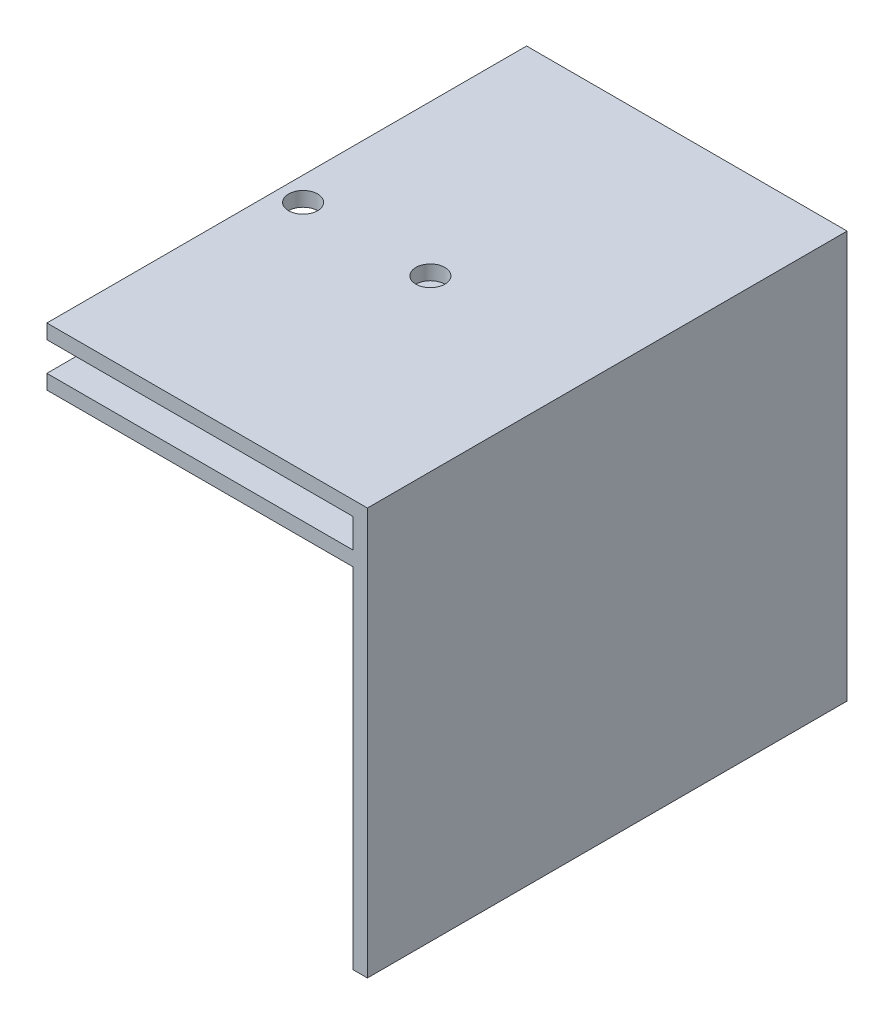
from build123d import *

# Parameters (mm, degrees)
BOSS_EXTRUDE1_DEPTH = 76.2
SKETCH2_W           = 70.0067765
SKETCH2_H           = 104.775
SKETCH2_R           = 3.175
BOSS_EXTRUDE2_DEPTH = 3.175
BOSS_EXTRUDE3_DEPTH = 6.35
SKETCH4_W           = 70.0067765
SKETCH4_H           = 104.775
SKETCH4_R           = 3.175
BOSS_EXTRUDE4_DEPTH = 3.175


with BuildPart() as part:
    # Sketch1 → Boss-Extrude1 (new body)
    with BuildSketch(Plane(origin=(0, 0, 0), x_dir=(1, 0, 0), z_dir=(0, 1, 0))):
        Polygon((7.9375, 50.8), (33.8709, 50.8), (33.8709, -50.8), (37.0459, -50.8), (37.0459, 53.975), (7.9375, 53.975), align=None)
    extrude(amount=BOSS_EXTRUDE1_DEPTH)

    # Sketch2 → Boss-Extrude2 (add)
    with BuildSketch(Plane(origin=(0, 76.2, 0), x_dir=(1, 0, 0), z_dir=(0, 1, 0))):
        with Locations((2.04251175, 1.5875)):
            Rectangle(SKETCH2_W, SKETCH2_H)
        with Locations(Location((0, 0, 0), (0, 0, 270))):
            Circle(SKETCH2_R, mode=Mode.SUBTRACT)
        with Locations(Location((-27.80029957, 0, 0), (0, 0, 270))):
            Circle(SKETCH2_R, mode=Mode.SUBTRACT)
    extrude(amount=BOSS_EXTRUDE2_DEPTH)

    # Sketch3 → Boss-Extrude3 (add)
    with BuildSketch(Plane(origin=(0, 79.375, 0), x_dir=(1, 0, 0), z_dir=(0, 1, 0))):
        Polygon((33.8709, 53.975), (-32.9608765, 53.975), (-32.9608765, 50.8), (33.8709, 50.8), (33.8709, -50.8), (37.0459, -50.8), (37.0459, 50.8), (37.0459, 53.975), align=None)
    extrude(amount=BOSS_EXTRUDE3_DEPTH)

    # Sketch4 → Boss-Extrude4 (add)
    with BuildSketch(Plane(origin=(0, 85.725, 0), x_dir=(1, 0, 0), z_dir=(0, 1, 0))):
        with Locations((2.04251175, 1.5875)):
            Rectangle(SKETCH4_W, SKETCH4_H)
        with Locations(Location((0, 0, 0), (0, 0, 270))):
            Circle(SKETCH4_R, mode=Mode.SUBTRACT)
        with Locations(Location((-27.80029957, 0, 0), (0, 0, 270))):
            Circle(SKETCH4_R, mode=Mode.SUBTRACT)
    extrude(amount=BOSS_EXTRUDE4_DEPTH)


solid = part.part
